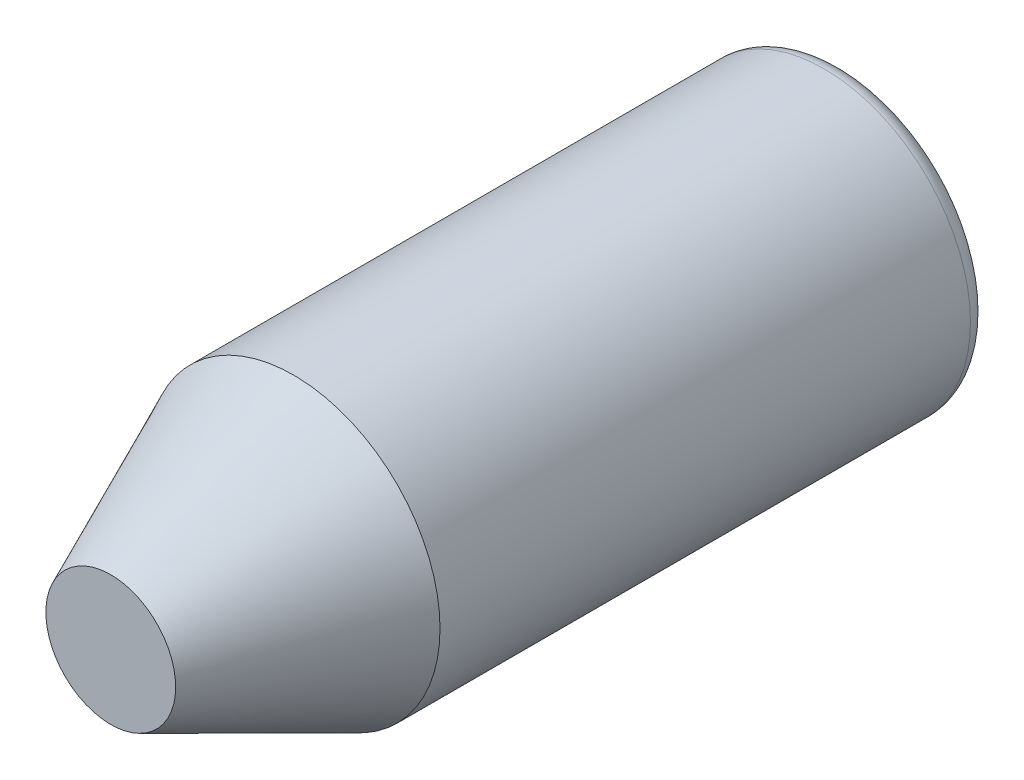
from build123d import *

# Parameters (mm, degrees)
ESQUISSE1_R             = 40
BOSS_EXTRU_1_DEPTH      = 150
CONG_1_R                = 5
ESQUISSE2_R             = 40
BOSS_EXTRU_2_DEPTH      = 50
BOSS_EXTRU_2_TAPER      = 24
ESQUISSE3_R             = 4.715984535
BOSS_EXTRU_3_DEPTH      = 50
ESQUISSE4_R             = 17.439965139
BOSS_EXTRU_4_DEPTH      = 5
CONG_2_R                = 2
ESQUISSE5_R             = 4.715984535
ESQUISSE7_R             = 95.58128453
ENL_V_MAT_EXTRU_1_DEPTH = 213.493333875


with BuildPart() as part:
    # Esquisse1 → Boss.-Extru.1 (new body)
    with BuildSketch(Plane.XY):
        Circle(ESQUISSE1_R)
    extrude(amount=BOSS_EXTRU_1_DEPTH)

    # Cong_1
    cong_1_edges = [part.edges().sort_by_distance(p)[0] for p in [
        (-40, 0, 0),
    ]]
    fillet(cong_1_edges, radius=CONG_1_R)

    # Esquisse2 → Boss.-Extru.2 (add)
    with BuildSketch(Plane.XY.offset(150)):
        Circle(ESQUISSE2_R)
    extrude(amount=BOSS_EXTRU_2_DEPTH, taper=BOSS_EXTRU_2_TAPER)

    # Esquisse3 → Boss.-Extru.3 (add)
    with BuildSketch(Plane.XY.offset(200)):
        Circle(ESQUISSE3_R)
    extrude(amount=BOSS_EXTRU_3_DEPTH)

    # Esquisse4 → Boss.-Extru.4 (add)
    with BuildSketch(Plane.XY.offset(250)):
        Circle(ESQUISSE4_R)
    extrude(amount=-BOSS_EXTRU_4_DEPTH)

    # Cong_2
    cong_2_edges = [part.edges().sort_by_distance(p)[0] for p in [
        (-17.439965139, 0, 250),
    ]]
    fillet(cong_2_edges, radius=CONG_2_R)

    # Balayage1: sweep along a path in Esquisse6
    with BuildLine(Plane(origin=(0, 0, 0), x_dir=(0, 0, -1), z_dir=(1, 0, 0))) as balayage1_path:
        Line((-220.147357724, 0), (-220.147357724, 23.018870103))
        Line((-220.147357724, 23.018870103), (-204.498740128, 57.669513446))
    # Esquisse5 → Balayage1 (sweep)
    with BuildSketch(Plane(origin=(0, 0, 0), x_dir=(1, 0, 0), z_dir=(0, 1, 0))):
        with Locations((0, -220.147357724)):
            Circle(ESQUISSE5_R)
    sweep(path=balayage1_path.line, transition=Transition.RIGHT)

    # Esquisse7 → Enl_v. mat.-Extru.1 (cut, through all)
    with BuildSketch(Plane.XY.offset(200)):
        Circle(ESQUISSE7_R)
    extrude(amount=ENL_V_MAT_EXTRU_1_DEPTH, mode=Mode.SUBTRACT)


solid = part.part
